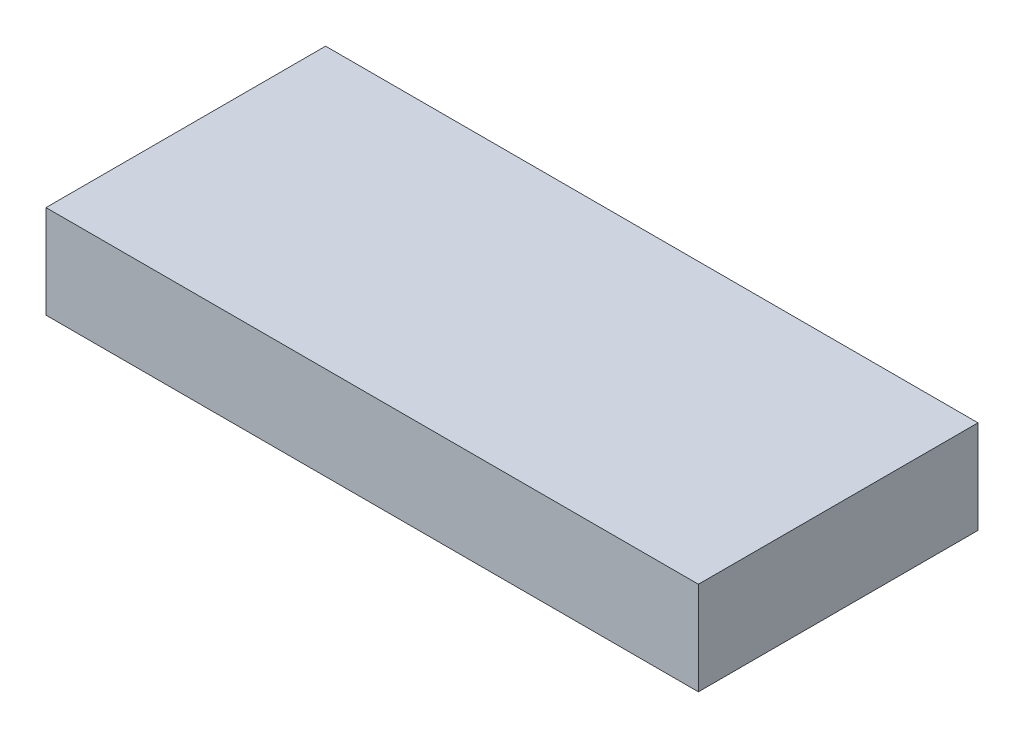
ISO-10303-21;
HEADER;
FILE_DESCRIPTION(('STEP AP214'),'2;1');
FILE_NAME('part.step','',(''),(''),'','','');
FILE_SCHEMA(('AUTOMOTIVE_DESIGN { 1 0 10303 214 1 1 1 1 }'));
ENDSEC;
DATA;
#1=APPLICATION_CONTEXT('core data for automotive mechanical design processes');
#2=APPLICATION_PROTOCOL_DEFINITION('international standard','automotive_design',2000,#1);
#3=PRODUCT_CONTEXT('',#1,'mechanical');
#4=PRODUCT('Part','Part','',(#3));
#5=PRODUCT_RELATED_PRODUCT_CATEGORY('part','',(#4));
#6=PRODUCT_DEFINITION_FORMATION('','',#4);
#7=PRODUCT_DEFINITION_CONTEXT('part definition',#1,'design');
#8=PRODUCT_DEFINITION('design','',#6,#7);
#9=PRODUCT_DEFINITION_SHAPE('','',#8);
#10=(LENGTH_UNIT() NAMED_UNIT(*) SI_UNIT(.MILLI.,.METRE.));
#11=(NAMED_UNIT(*) PLANE_ANGLE_UNIT() SI_UNIT($,.RADIAN.));
#12=(NAMED_UNIT(*) SI_UNIT($,.STERADIAN.) SOLID_ANGLE_UNIT());
#13=UNCERTAINTY_MEASURE_WITH_UNIT(LENGTH_MEASURE(1.E-05),#10,'distance_accuracy_value','');
#14=(GEOMETRIC_REPRESENTATION_CONTEXT(3) GLOBAL_UNCERTAINTY_ASSIGNED_CONTEXT((#13)) GLOBAL_UNIT_ASSIGNED_CONTEXT((#10,
#11,#12)) REPRESENTATION_CONTEXT('',''));
#15=CARTESIAN_POINT('',(0.,0.,0.));
#16=DIRECTION('',(0.,0.,1.));
#17=DIRECTION('',(1.,0.,0.));
#18=AXIS2_PLACEMENT_3D('',#15,#16,#17);
#19=CARTESIAN_POINT('',(-350.,-50.,150.));
#20=DIRECTION('',(1.,0.,0.));
#21=DIRECTION('',(0.,0.,-1.));
#22=AXIS2_PLACEMENT_3D('',#19,#20,#21);
#23=PLANE('',#22);
#24=DIRECTION('',(0.,-1.,0.));
#25=VECTOR('',#24,1.);
#26=CARTESIAN_POINT('',(-350.,-50.,-150.));
#27=LINE('',#26,#25);
#28=CARTESIAN_POINT('',(-350.,50.,-150.));
#29=VERTEX_POINT('',#28);
#30=CARTESIAN_POINT('',(-350.,-50.,-150.));
#31=VERTEX_POINT('',#30);
#32=EDGE_CURVE('E97',#29,#31,#27,.T.);
#33=ORIENTED_EDGE('',*,*,#32,.T.);
#34=DIRECTION('',(0.,0.,-1.));
#35=VECTOR('',#34,1.);
#36=CARTESIAN_POINT('',(-350.,-50.,150.));
#37=LINE('',#36,#35);
#38=CARTESIAN_POINT('',(-350.,-50.,150.));
#39=VERTEX_POINT('',#38);
#40=EDGE_CURVE('E11',#39,#31,#37,.T.);
#41=ORIENTED_EDGE('',*,*,#40,.F.);
#42=DIRECTION('',(0.,-1.,0.));
#43=VECTOR('',#42,1.);
#44=CARTESIAN_POINT('',(-350.,-50.,150.));
#45=LINE('',#44,#43);
#46=CARTESIAN_POINT('',(-350.,50.,150.));
#47=VERTEX_POINT('',#46);
#48=EDGE_CURVE('E85',#47,#39,#45,.T.);
#49=ORIENTED_EDGE('',*,*,#48,.F.);
#50=DIRECTION('',(0.,0.,-1.));
#51=VECTOR('',#50,1.);
#52=CARTESIAN_POINT('',(-350.,50.,150.));
#53=LINE('',#52,#51);
#54=EDGE_CURVE('E93',#47,#29,#53,.T.);
#55=ORIENTED_EDGE('',*,*,#54,.T.);
#56=EDGE_LOOP('',(#33,#41,#49,#55));
#57=FACE_BOUND('',#56,.T.);
#58=ADVANCED_FACE('F34',(#57),#23,.F.);
#59=CARTESIAN_POINT('',(350.,-50.,150.));
#60=DIRECTION('',(0.,1.,0.));
#61=DIRECTION('',(-1.,0.,0.));
#62=AXIS2_PLACEMENT_3D('',#59,#60,#61);
#63=PLANE('',#62);
#64=DIRECTION('',(1.,0.,0.));
#65=VECTOR('',#64,1.);
#66=CARTESIAN_POINT('',(350.,-50.,-150.));
#67=LINE('',#66,#65);
#68=CARTESIAN_POINT('',(350.,-50.,-150.));
#69=VERTEX_POINT('',#68);
#70=EDGE_CURVE('E89',#31,#69,#67,.T.);
#71=ORIENTED_EDGE('',*,*,#70,.T.);
#72=DIRECTION('',(0.,0.,-1.));
#73=VECTOR('',#72,1.);
#74=CARTESIAN_POINT('',(350.,-50.,150.));
#75=LINE('',#74,#73);
#76=CARTESIAN_POINT('',(350.,-50.,150.));
#77=VERTEX_POINT('',#76);
#78=EDGE_CURVE('E42',#77,#69,#75,.T.);
#79=ORIENTED_EDGE('',*,*,#78,.F.);
#80=DIRECTION('',(1.,0.,0.));
#81=VECTOR('',#80,1.);
#82=CARTESIAN_POINT('',(350.,-50.,150.));
#83=LINE('',#82,#81);
#84=EDGE_CURVE('E80',#39,#77,#83,.T.);
#85=ORIENTED_EDGE('',*,*,#84,.F.);
#86=ORIENTED_EDGE('',*,*,#40,.T.);
#87=EDGE_LOOP('',(#71,#79,#85,#86));
#88=FACE_BOUND('',#87,.T.);
#89=ADVANCED_FACE('F88',(#88),#63,.F.);
#90=CARTESIAN_POINT('',(350.,-50.,150.));
#91=DIRECTION('',(-1.,0.,0.));
#92=DIRECTION('',(0.,0.,1.));
#93=AXIS2_PLACEMENT_3D('',#90,#91,#92);
#94=PLANE('',#93);
#95=DIRECTION('',(0.,1.,0.));
#96=VECTOR('',#95,1.);
#97=CARTESIAN_POINT('',(350.,-50.,-150.));
#98=LINE('',#97,#96);
#99=CARTESIAN_POINT('',(350.,50.,-150.));
#100=VERTEX_POINT('',#99);
#101=EDGE_CURVE('E67',#69,#100,#98,.T.);
#102=ORIENTED_EDGE('',*,*,#101,.T.);
#103=DIRECTION('',(0.,0.,-1.));
#104=VECTOR('',#103,1.);
#105=CARTESIAN_POINT('',(350.,50.,150.));
#106=LINE('',#105,#104);
#107=CARTESIAN_POINT('',(350.,50.,150.));
#108=VERTEX_POINT('',#107);
#109=EDGE_CURVE('E90',#108,#100,#106,.T.);
#110=ORIENTED_EDGE('',*,*,#109,.F.);
#111=DIRECTION('',(0.,1.,0.));
#112=VECTOR('',#111,1.);
#113=CARTESIAN_POINT('',(350.,-50.,150.));
#114=LINE('',#113,#112);
#115=EDGE_CURVE('E83',#77,#108,#114,.T.);
#116=ORIENTED_EDGE('',*,*,#115,.F.);
#117=ORIENTED_EDGE('',*,*,#78,.T.);
#118=EDGE_LOOP('',(#102,#110,#116,#117));
#119=FACE_BOUND('',#118,.T.);
#120=ADVANCED_FACE('F91',(#119),#94,.F.);
#121=CARTESIAN_POINT('',(350.,50.,150.));
#122=DIRECTION('',(0.,-1.,0.));
#123=DIRECTION('',(1.,0.,0.));
#124=AXIS2_PLACEMENT_3D('',#121,#122,#123);
#125=PLANE('',#124);
#126=DIRECTION('',(-1.,0.,0.));
#127=VECTOR('',#126,1.);
#128=CARTESIAN_POINT('',(350.,50.,-150.));
#129=LINE('',#128,#127);
#130=EDGE_CURVE('E73',#100,#29,#129,.T.);
#131=ORIENTED_EDGE('',*,*,#130,.T.);
#132=ORIENTED_EDGE('',*,*,#54,.F.);
#133=DIRECTION('',(-1.,0.,0.));
#134=VECTOR('',#133,1.);
#135=CARTESIAN_POINT('',(350.,50.,150.));
#136=LINE('',#135,#134);
#137=EDGE_CURVE('E50',#108,#47,#136,.T.);
#138=ORIENTED_EDGE('',*,*,#137,.F.);
#139=ORIENTED_EDGE('',*,*,#109,.T.);
#140=EDGE_LOOP('',(#131,#132,#138,#139));
#141=FACE_BOUND('',#140,.T.);
#142=ADVANCED_FACE('F104',(#141),#125,.F.);
#143=CARTESIAN_POINT('',(0.,0.,150.));
#144=DIRECTION('',(0.,0.,1.));
#145=DIRECTION('',(1.,0.,0.));
#146=AXIS2_PLACEMENT_3D('',#143,#144,#145);
#147=PLANE('',#146);
#148=ORIENTED_EDGE('',*,*,#48,.T.);
#149=ORIENTED_EDGE('',*,*,#84,.T.);
#150=ORIENTED_EDGE('',*,*,#115,.T.);
#151=ORIENTED_EDGE('',*,*,#137,.T.);
#152=EDGE_LOOP('',(#148,#149,#150,#151));
#153=FACE_BOUND('',#152,.T.);
#154=ADVANCED_FACE('F81',(#153),#147,.T.);
#155=CARTESIAN_POINT('',(0.,0.,-150.));
#156=DIRECTION('',(0.,0.,1.));
#157=DIRECTION('',(1.,0.,0.));
#158=AXIS2_PLACEMENT_3D('',#155,#156,#157);
#159=PLANE('',#158);
#160=ORIENTED_EDGE('',*,*,#32,.F.);
#161=ORIENTED_EDGE('',*,*,#130,.F.);
#162=ORIENTED_EDGE('',*,*,#101,.F.);
#163=ORIENTED_EDGE('',*,*,#70,.F.);
#164=EDGE_LOOP('',(#160,#161,#162,#163));
#165=FACE_BOUND('',#164,.T.);
#166=ADVANCED_FACE('F107',(#165),#159,.F.);
#167=CLOSED_SHELL('',(#58,#89,#120,#142,#154,#166));
#168=MANIFOLD_SOLID_BREP('B2',#167);
#169=ADVANCED_BREP_SHAPE_REPRESENTATION('',(#18,#168),#14);
#170=SHAPE_DEFINITION_REPRESENTATION(#9,#169);
ENDSEC;
END-ISO-10303-21;
